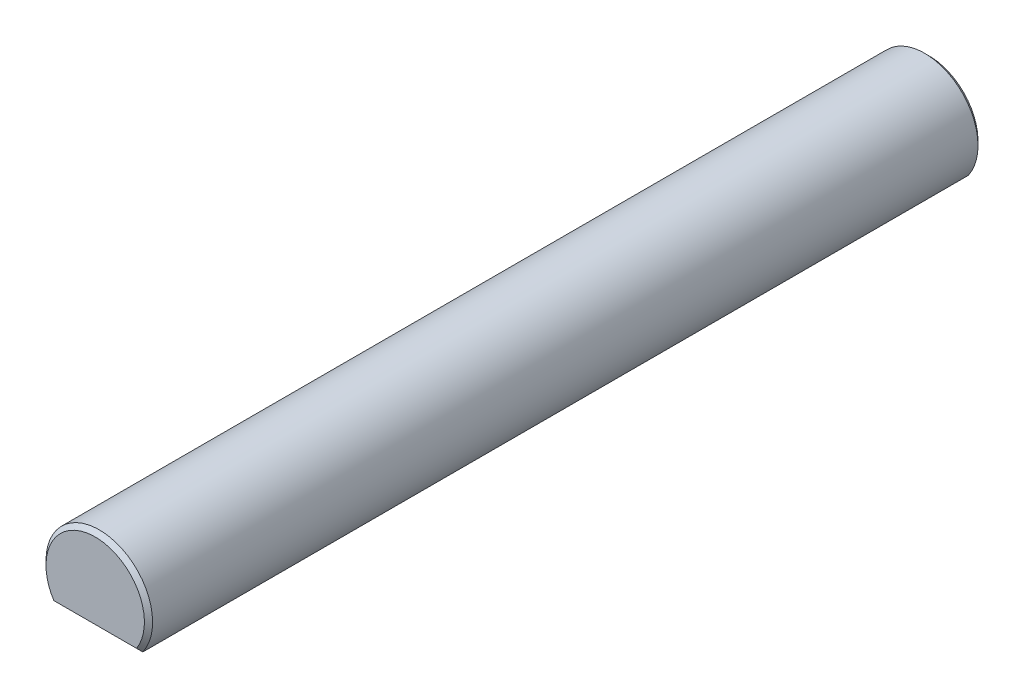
from build123d import *

# Parameters (mm, degrees)
BOSS_EXTRUDE1_DEPTH = 122
CHAMFER1_SIZE       = 0.6


with BuildPart() as part:
    # Sketch1 → Boss-Extrude1 (new body)
    with BuildSketch(Plane.XY):
        with BuildLine():
            Line((-6.371028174, -4.5), (6.371028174, -4.5))
            ThreePointArc((6.371028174, -4.5), (0, 7.8), (-6.371028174, -4.5))
        make_face()
    extrude(amount=BOSS_EXTRUDE1_DEPTH)

    # Chamfer1
    chamfer1_edges = [part.edges().sort_by_distance(p)[0] for p in [
        (0, -4.5, 0),
        (0, 7.8, 0),
        (0, 7.8, 122),
        (0, -4.5, 122),
    ]]
    chamfer(chamfer1_edges, length=CHAMFER1_SIZE)


solid = part.part
